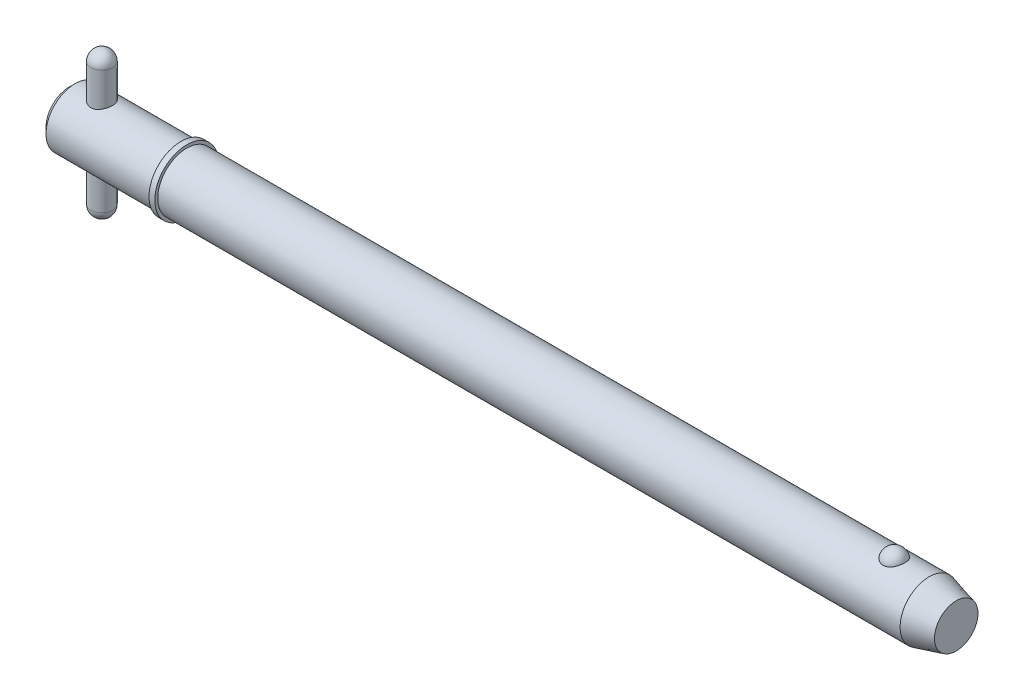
ISO-10303-21;
HEADER;
FILE_DESCRIPTION(('STEP AP214'),'2;1');
FILE_NAME('part.step','',(''),(''),'','','');
FILE_SCHEMA(('AUTOMOTIVE_DESIGN { 1 0 10303 214 1 1 1 1 }'));
ENDSEC;
DATA;
#1=APPLICATION_CONTEXT('core data for automotive mechanical design processes');
#2=APPLICATION_PROTOCOL_DEFINITION('international standard','automotive_design',2000,#1);
#3=PRODUCT_CONTEXT('',#1,'mechanical');
#4=PRODUCT('Part','Part','',(#3));
#5=PRODUCT_RELATED_PRODUCT_CATEGORY('part','',(#4));
#6=PRODUCT_DEFINITION_FORMATION('','',#4);
#7=PRODUCT_DEFINITION_CONTEXT('part definition',#1,'design');
#8=PRODUCT_DEFINITION('design','',#6,#7);
#9=PRODUCT_DEFINITION_SHAPE('','',#8);
#10=(LENGTH_UNIT() NAMED_UNIT(*) SI_UNIT(.MILLI.,.METRE.));
#11=(NAMED_UNIT(*) PLANE_ANGLE_UNIT() SI_UNIT($,.RADIAN.));
#12=(NAMED_UNIT(*) SI_UNIT($,.STERADIAN.) SOLID_ANGLE_UNIT());
#13=UNCERTAINTY_MEASURE_WITH_UNIT(LENGTH_MEASURE(1.E-05),#10,'distance_accuracy_value','');
#14=(GEOMETRIC_REPRESENTATION_CONTEXT(3) GLOBAL_UNCERTAINTY_ASSIGNED_CONTEXT((#13)) GLOBAL_UNIT_ASSIGNED_CONTEXT((#10,
#11,#12)) REPRESENTATION_CONTEXT('',''));
#15=CARTESIAN_POINT('',(0.,0.,0.));
#16=DIRECTION('',(0.,0.,1.));
#17=DIRECTION('',(1.,0.,0.));
#18=AXIS2_PLACEMENT_3D('',#15,#16,#17);
#19=CARTESIAN_POINT('',(7.14,15.875,0.));
#20=DIRECTION('',(0.,-1.,0.));
#21=DIRECTION('',(0.,0.,-1.));
#22=AXIS2_PLACEMENT_3D('',#19,#20,#21);
#23=CYLINDRICAL_SURFACE('',#22,2.38);
#24=CARTESIAN_POINT('',(7.14,-13.495,0.));
#25=DIRECTION('',(0.,-1.,0.));
#26=DIRECTION('',(0.,0.,-1.));
#27=AXIS2_PLACEMENT_3D('',#24,#25,#26);
#28=CIRCLE('',#27,2.38);
#29=CARTESIAN_POINT('',(7.14,-13.495,-2.38));
#30=VERTEX_POINT('',#29);
#31=EDGE_CURVE('P0_E10',#30,#30,#28,.F.);
#32=ORIENTED_EDGE('',*,*,#31,.T.);
#33=EDGE_LOOP('',(#32));
#34=FACE_BOUND('',#33,.T.);
#35=CARTESIAN_POINT('',(7.14,13.495,0.));
#36=DIRECTION('',(0.,-1.,0.));
#37=DIRECTION('',(0.,0.,-1.));
#38=AXIS2_PLACEMENT_3D('',#35,#36,#37);
#39=CIRCLE('',#38,2.38);
#40=CARTESIAN_POINT('',(7.14,13.495,-2.38));
#41=VERTEX_POINT('',#40);
#42=EDGE_CURVE('P0_E21',#41,#41,#39,.T.);
#43=ORIENTED_EDGE('',*,*,#42,.T.);
#44=EDGE_LOOP('',(#43));
#45=FACE_BOUND('',#44,.T.);
#46=ADVANCED_FACE('P0_F14',(#34,#45),#23,.T.);
#47=CARTESIAN_POINT('',(7.14,-13.495,0.));
#48=DIRECTION('',(0.,0.,1.));
#49=DIRECTION('',(1.,0.,0.));
#50=AXIS2_PLACEMENT_3D('',#47,#48,#49);
#51=SPHERICAL_SURFACE('',#50,2.38);
#52=CARTESIAN_POINT('',(7.14,-13.495,0.));
#53=DIRECTION('',(0.,-1.,0.));
#54=DIRECTION('',(0.,0.,-1.));
#55=AXIS2_PLACEMENT_3D('',#52,#53,#54);
#56=SPHERICAL_SURFACE('',#55,2.38);
#57=ORIENTED_EDGE('',*,*,#31,.F.);
#58=EDGE_LOOP('',(#57));
#59=FACE_BOUND('',#58,.T.);
#60=ADVANCED_FACE('P0_F29',(#59),#56,.T.);
#61=CARTESIAN_POINT('',(7.14,13.495,0.));
#62=DIRECTION('',(0.,0.,1.));
#63=DIRECTION('',(1.,0.,0.));
#64=AXIS2_PLACEMENT_3D('',#61,#62,#63);
#65=SPHERICAL_SURFACE('',#64,2.38);
#66=CARTESIAN_POINT('',(7.14,13.495,0.));
#67=DIRECTION('',(0.,-1.,0.));
#68=DIRECTION('',(0.,0.,-1.));
#69=AXIS2_PLACEMENT_3D('',#66,#67,#68);
#70=SPHERICAL_SURFACE('',#69,2.38);
#71=ORIENTED_EDGE('',*,*,#42,.F.);
#72=EDGE_LOOP('',(#71));
#73=FACE_BOUND('',#72,.T.);
#74=ADVANCED_FACE('P0_F16',(#73),#70,.T.);
#75=CLOSED_SHELL('',(#46,#60,#74));
#76=MANIFOLD_SOLID_BREP('P0_B1',#75);
#77=CARTESIAN_POINT('',(0.,0.,0.));
#78=DIRECTION('',(1.,0.,0.));
#79=DIRECTION('',(0.,0.,-1.));
#80=AXIS2_PLACEMENT_3D('',#77,#78,#79);
#81=CYLINDRICAL_SURFACE('',#80,6.35);
#82=CARTESIAN_POINT('',(188.055369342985,0.,0.));
#83=DIRECTION('',(1.,0.,0.));
#84=DIRECTION('',(0.,0.,-1.));
#85=AXIS2_PLACEMENT_3D('',#82,#83,#84);
#86=CIRCLE('',#85,6.35);
#87=CARTESIAN_POINT('',(188.055369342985,0.,-6.35));
#88=VERTEX_POINT('',#87);
#89=EDGE_CURVE('P1_E81',#88,#88,#86,.T.);
#90=ORIENTED_EDGE('',*,*,#89,.F.);
#91=EDGE_LOOP('',(#90));
#92=FACE_BOUND('',#91,.T.);
#93=CARTESIAN_POINT('',(25.7,0.,0.));
#94=DIRECTION('',(1.,0.,0.));
#95=DIRECTION('',(0.,0.,-1.));
#96=AXIS2_PLACEMENT_3D('',#93,#94,#95);
#97=CIRCLE('',#96,6.35);
#98=CARTESIAN_POINT('',(25.7,0.,-6.35));
#99=VERTEX_POINT('',#98);
#100=EDGE_CURVE('P1_E85',#99,#99,#97,.T.);
#101=ORIENTED_EDGE('',*,*,#100,.T.);
#102=EDGE_LOOP('',(#101));
#103=FACE_BOUND('',#102,.T.);
#104=CARTESIAN_POINT('',(180.430021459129,5.87502187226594,2.40969251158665));
#105=CARTESIAN_POINT('',(180.305030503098,5.87501645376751,2.40969773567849));
#106=CARTESIAN_POINT('',(180.180080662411,5.87916061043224,2.39967292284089));
#107=CARTESIAN_POINT('',(179.933909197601,5.89523112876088,2.35991730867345));
#108=CARTESIAN_POINT('',(179.812686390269,5.90715499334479,2.33019283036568));
#109=CARTESIAN_POINT('',(179.577517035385,5.93739567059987,2.25201402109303));
#110=CARTESIAN_POINT('',(179.463560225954,5.95570321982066,2.20358681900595));
#111=CARTESIAN_POINT('',(179.24557352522,5.9967206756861,2.08937987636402));
#112=CARTESIAN_POINT('',(179.141545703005,6.0194314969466,2.02359652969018));
#113=CARTESIAN_POINT('',(178.942943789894,6.06760647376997,1.87428969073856));
#114=CARTESIAN_POINT('',(178.848726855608,6.09313095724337,1.79031110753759));
#115=CARTESIAN_POINT('',(178.675255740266,6.14375873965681,1.60800178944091));
#116=CARTESIAN_POINT('',(178.596004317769,6.16886196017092,1.50966841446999));
#117=CARTESIAN_POINT('',(178.450845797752,6.21724600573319,1.29645884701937));
#118=CARTESIAN_POINT('',(178.385688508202,6.24039621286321,1.1810415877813));
#119=CARTESIAN_POINT('',(178.274703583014,6.28117277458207,0.940351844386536));
#120=CARTESIAN_POINT('',(178.228877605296,6.29879865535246,0.815078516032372));
#121=CARTESIAN_POINT('',(178.157023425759,6.32692073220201,0.556494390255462));
#122=CARTESIAN_POINT('',(178.131249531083,6.33732517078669,0.423102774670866));
#123=CARTESIAN_POINT('',(178.100988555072,6.34957673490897,0.153542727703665));
#124=CARTESIAN_POINT('',(178.096500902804,6.35142408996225,0.0173743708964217));
#125=CARTESIAN_POINT('',(178.108865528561,6.34638925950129,-0.25303667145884));
#126=CARTESIAN_POINT('',(178.125594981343,6.33955731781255,-0.387285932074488));
#127=CARTESIAN_POINT('',(178.179843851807,6.31794129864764,-0.650851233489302));
#128=CARTESIAN_POINT('',(178.217363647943,6.3031570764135,-0.780167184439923));
#129=CARTESIAN_POINT('',(178.312500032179,6.26711642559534,-1.03041949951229));
#130=CARTESIAN_POINT('',(178.370143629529,6.24585130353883,-1.15134433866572));
#131=CARTESIAN_POINT('',(178.504352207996,6.19905619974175,-1.38129800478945));
#132=CARTESIAN_POINT('',(178.580918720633,6.17352587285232,-1.49032586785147));
#133=CARTESIAN_POINT('',(178.751753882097,6.12080227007,-1.69393164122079));
#134=CARTESIAN_POINT('',(178.846100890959,6.09360200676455,-1.78844209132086));
#135=CARTESIAN_POINT('',(179.050119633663,6.04070434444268,-1.95970536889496));
#136=CARTESIAN_POINT('',(179.159790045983,6.015006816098,-2.0364597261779));
#137=CARTESIAN_POINT('',(179.389187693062,5.96867714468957,-2.16845644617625));
#138=CARTESIAN_POINT('',(179.508652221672,5.94794910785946,-2.22412062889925));
#139=CARTESIAN_POINT('',(179.756218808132,5.91340580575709,-2.31440992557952));
#140=CARTESIAN_POINT('',(179.884317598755,5.89958794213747,-2.34904294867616));
#141=CARTESIAN_POINT('',(180.138582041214,5.88111049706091,-2.39491590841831));
#142=CARTESIAN_POINT('',(180.264520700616,5.87602512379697,-2.40724512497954));
#143=CARTESIAN_POINT('',(180.516786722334,5.87428980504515,-2.41147867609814));
#144=CARTESIAN_POINT('',(180.643114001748,5.8776381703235,-2.40338710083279));
#145=CARTESIAN_POINT('',(180.888417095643,5.89212921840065,-2.36762715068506));
#146=CARTESIAN_POINT('',(181.007499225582,5.90302431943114,-2.3405803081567));
#147=CARTESIAN_POINT('',(181.23924472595,5.93113752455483,-2.26839066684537));
#148=CARTESIAN_POINT('',(181.351907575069,5.94835614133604,-2.22324640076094));
#149=CARTESIAN_POINT('',(181.570400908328,5.9877301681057,-2.11493806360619));
#150=CARTESIAN_POINT('',(181.676028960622,6.00998499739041,-2.05140269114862));
#151=CARTESIAN_POINT('',(181.875300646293,6.05690144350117,-1.90842705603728));
#152=CARTESIAN_POINT('',(181.968941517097,6.08156361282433,-1.82898313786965));
#153=CARTESIAN_POINT('',(182.146675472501,6.13211715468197,-1.65182429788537));
#154=CARTESIAN_POINT('',(182.230055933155,6.15800825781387,-1.55339381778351));
#155=CARTESIAN_POINT('',(182.379790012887,6.20712834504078,-1.34374214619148));
#156=CARTESIAN_POINT('',(182.446140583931,6.23035685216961,-1.23251867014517));
#157=CARTESIAN_POINT('',(182.562345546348,6.27251177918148,-0.996447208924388));
#158=CARTESIAN_POINT('',(182.611607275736,6.29127762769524,-0.871278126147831));
#159=CARTESIAN_POINT('',(182.689614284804,6.3215862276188,-0.613870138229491));
#160=CARTESIAN_POINT('',(182.718359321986,6.33312889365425,-0.481631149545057));
#161=CARTESIAN_POINT('',(182.754770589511,6.34782349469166,-0.213672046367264));
#162=CARTESIAN_POINT('',(182.762413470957,6.35096613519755,-0.0779482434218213));
#163=CARTESIAN_POINT('',(182.756395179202,6.34851322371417,0.192943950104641));
#164=CARTESIAN_POINT('',(182.742734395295,6.3429178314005,0.328112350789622));
#165=CARTESIAN_POINT('',(182.69450361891,6.32360512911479,0.593406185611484));
#166=CARTESIAN_POINT('',(182.660031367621,6.30992579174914,0.723552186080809));
#167=CARTESIAN_POINT('',(182.570953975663,6.27586325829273,0.97583417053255));
#168=CARTESIAN_POINT('',(182.51634761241,6.25547965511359,1.09796966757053));
#169=CARTESIAN_POINT('',(182.38775879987,6.20998183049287,1.33148921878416));
#170=CARTESIAN_POINT('',(182.313674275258,6.18484288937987,1.44281227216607));
#171=CARTESIAN_POINT('',(182.147820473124,6.13258735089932,1.65087683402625));
#172=CARTESIAN_POINT('',(182.056051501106,6.10547078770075,1.7476185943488));
#173=CARTESIAN_POINT('',(181.857183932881,6.05235879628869,1.92350926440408));
#174=CARTESIAN_POINT('',(181.750133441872,6.02636017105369,2.00271146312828));
#175=CARTESIAN_POINT('',(181.523138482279,5.97843747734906,2.14154159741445));
#176=CARTESIAN_POINT('',(181.403191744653,5.9565141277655,2.20116608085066));
#177=CARTESIAN_POINT('',(181.144523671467,5.91812106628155,2.30250570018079));
#178=CARTESIAN_POINT('',(181.00506980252,5.90217533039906,2.34256795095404));
#179=CARTESIAN_POINT('',(180.720397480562,5.88063128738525,2.3961521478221));
#180=CARTESIAN_POINT('',(180.57518174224,5.87502816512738,2.40968644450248));
#181=CARTESIAN_POINT('',(180.430021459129,5.87502187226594,2.40969251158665));
#182=B_SPLINE_CURVE_WITH_KNOTS('',3,(#104,#105,#106,#107,#108,#109,#110,#111,#112,#113,#114,
#115,#116,#117,#118,#119,#120,#121,#122,#123,#124,#125,#126,#127,#128,#129,#130,#131,#132,#133,
#134,#135,#136,#137,#138,#139,#140,#141,#142,#143,#144,#145,#146,#147,#148,#149,#150,#151,#152,
#153,#154,#155,#156,#157,#158,#159,#160,#161,#162,#163,#164,#165,#166,#167,#168,#169,#170,#171,
#172,#173,#174,#175,#176,#177,#178,#179,#180,#181),.UNSPECIFIED.,.T.,.F.,(4,2,2,2,2,2,2,2,2,2,2,
2,2,2,2,2,2,2,2,2,2,2,2,2,2,2,2,2,2,2,2,2,2,2,2,2,2,2,4),(0.,0.374440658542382,
0.748761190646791,1.12254078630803,1.4963981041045,1.88098871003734,2.26565013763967,
2.66741104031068,3.06920639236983,3.47601794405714,3.88281858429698,4.28727498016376,
4.69173873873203,5.09674745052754,5.50178895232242,5.90865911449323,6.31549420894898,
6.71369855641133,7.11175305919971,7.48978077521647,7.86773278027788,8.23383886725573,
8.59997464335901,8.97409044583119,9.34829231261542,9.74122667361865,10.1342313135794,
10.5397522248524,10.9452779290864,11.3512521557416,11.75721896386,12.1612938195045,
12.5653932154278,12.9716540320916,13.3779078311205,13.7829098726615,14.1879832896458,
14.6230486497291,15.0579114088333),.UNSPECIFIED.);
#183=CARTESIAN_POINT('',(180.430021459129,5.87502187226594,2.40969251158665));
#184=VERTEX_POINT('',#183);
#185=EDGE_CURVE('P1_E35',#184,#184,#182,.T.);
#186=ORIENTED_EDGE('',*,*,#185,.T.);
#187=EDGE_LOOP('',(#186));
#188=FACE_BOUND('',#187,.T.);
#189=ADVANCED_FACE('P1_F13',(#92,#103,#188),#81,.T.);
#190=CARTESIAN_POINT('',(0.,0.,0.));
#191=DIRECTION('',(-1.,0.,0.));
#192=DIRECTION('',(0.,0.,1.));
#193=AXIS2_PLACEMENT_3D('',#190,#191,#192);
#194=PLANE('',#193);
#195=CARTESIAN_POINT('',(0.,0.,0.));
#196=DIRECTION('',(1.,0.,0.));
#197=DIRECTION('',(0.,0.,-1.));
#198=AXIS2_PLACEMENT_3D('',#195,#196,#197);
#199=CIRCLE('',#198,5.08);
#200=CARTESIAN_POINT('',(0.,0.,-5.08));
#201=VERTEX_POINT('',#200);
#202=EDGE_CURVE('P1_E9',#201,#201,#199,.T.);
#203=ORIENTED_EDGE('',*,*,#202,.F.);
#204=EDGE_LOOP('',(#203));
#205=FACE_BOUND('',#204,.T.);
#206=ADVANCED_FACE('P1_F15',(#205),#194,.T.);
#207=CARTESIAN_POINT('',(1.27,0.,0.));
#208=DIRECTION('',(1.,0.,0.));
#209=DIRECTION('',(0.,0.,-1.));
#210=AXIS2_PLACEMENT_3D('',#207,#208,#209);
#211=CONICAL_SURFACE('',#210,6.35,0.78539816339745);
#212=ORIENTED_EDGE('',*,*,#202,.T.);
#213=EDGE_LOOP('',(#212));
#214=FACE_BOUND('',#213,.T.);
#215=CARTESIAN_POINT('',(1.27,0.,0.));
#216=DIRECTION('',(1.,0.,0.));
#217=DIRECTION('',(0.,0.,-1.));
#218=AXIS2_PLACEMENT_3D('',#215,#216,#217);
#219=CIRCLE('',#218,6.35);
#220=CARTESIAN_POINT('',(1.27,0.,-6.35));
#221=VERTEX_POINT('',#220);
#222=EDGE_CURVE('P1_E26',#221,#221,#219,.T.);
#223=ORIENTED_EDGE('',*,*,#222,.F.);
#224=EDGE_LOOP('',(#223));
#225=FACE_BOUND('',#224,.T.);
#226=ADVANCED_FACE('P1_F77',(#214,#225),#211,.T.);
#227=CARTESIAN_POINT('',(0.,0.,0.));
#228=DIRECTION('',(1.,0.,0.));
#229=DIRECTION('',(0.,0.,-1.));
#230=AXIS2_PLACEMENT_3D('',#227,#228,#229);
#231=CYLINDRICAL_SURFACE('',#230,6.35);
#232=CARTESIAN_POINT('',(7.14,-5.88711304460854,2.38));
#233=CARTESIAN_POINT('',(7.01146258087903,-5.88710856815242,2.38000480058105));
#234=CARTESIAN_POINT('',(6.88295682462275,-5.89136840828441,2.36955244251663));
#235=CARTESIAN_POINT('',(6.62981934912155,-5.90782785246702,2.32820953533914));
#236=CARTESIAN_POINT('',(6.50518751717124,-5.92002722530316,2.29731958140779));
#237=CARTESIAN_POINT('',(6.26352403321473,-5.95079384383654,2.21639366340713));
#238=CARTESIAN_POINT('',(6.14647496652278,-5.96934583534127,2.16640353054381));
#239=CARTESIAN_POINT('',(5.92237941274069,-6.01070278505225,2.04885862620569));
#240=CARTESIAN_POINT('',(5.81533593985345,-6.03350901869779,1.98129858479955));
#241=CARTESIAN_POINT('',(5.60897525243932,-6.08207341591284,1.82693902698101));
#242=CARTESIAN_POINT('',(5.51022503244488,-6.10791836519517,1.73940861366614));
#243=CARTESIAN_POINT('',(5.32840561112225,-6.15892405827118,1.54914379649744));
#244=CARTESIAN_POINT('',(5.24533975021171,-6.1840846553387,1.44640616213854));
#245=CARTESIAN_POINT('',(5.09451639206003,-6.23191821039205,1.22434014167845));
#246=CARTESIAN_POINT('',(5.02737511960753,-6.25447755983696,1.10456656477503));
#247=CARTESIAN_POINT('',(4.91443001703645,-6.2935236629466,0.854429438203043));
#248=CARTESIAN_POINT('',(4.86861879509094,-6.31001251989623,0.724069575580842));
#249=CARTESIAN_POINT('',(4.80162253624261,-6.33444370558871,0.46242122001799));
#250=CARTESIAN_POINT('',(4.77946137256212,-6.34272370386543,0.331414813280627));
#251=CARTESIAN_POINT('',(4.75726677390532,-6.35101600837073,0.0672982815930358));
#252=CARTESIAN_POINT('',(4.75722615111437,-6.35103100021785,-0.0658111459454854));
#253=CARTESIAN_POINT('',(4.77870510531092,-6.3430064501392,-0.323358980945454));
#254=CARTESIAN_POINT('',(4.79915922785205,-6.33536494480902,-0.447900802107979));
#255=CARTESIAN_POINT('',(4.85925493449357,-6.31340794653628,-0.69163609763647));
#256=CARTESIAN_POINT('',(4.89889787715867,-6.29909198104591,-0.810829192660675));
#257=CARTESIAN_POINT('',(4.9967414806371,-6.26494471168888,-1.04254212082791));
#258=CARTESIAN_POINT('',(5.05520370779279,-6.24503620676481,-1.1549396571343));
#259=CARTESIAN_POINT('',(5.1887948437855,-6.20171869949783,-1.3686079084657));
#260=CARTESIAN_POINT('',(5.26392912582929,-6.17830856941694,-1.46987502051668));
#261=CARTESIAN_POINT('',(5.43386591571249,-6.12878580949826,-1.66468415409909));
#262=CARTESIAN_POINT('',(5.52956139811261,-6.10259519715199,-1.75742857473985));
#263=CARTESIAN_POINT('',(5.73530435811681,-6.05155777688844,-1.92585331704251));
#264=CARTESIAN_POINT('',(5.84535542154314,-6.02671130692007,-2.00152936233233));
#265=CARTESIAN_POINT('',(6.07982989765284,-5.98068420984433,-2.13519109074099));
#266=CARTESIAN_POINT('',(6.20451768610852,-5.95959698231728,-2.19274775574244));
#267=CARTESIAN_POINT('',(6.4628145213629,-5.92455622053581,-2.28574558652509));
#268=CARTESIAN_POINT('',(6.59641856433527,-5.91059872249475,-2.32119904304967));
#269=CARTESIAN_POINT('',(6.86087441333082,-5.8923327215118,-2.36717069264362));
#270=CARTESIAN_POINT('',(6.99147192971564,-5.8875347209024,-2.37895573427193));
#271=CARTESIAN_POINT('',(7.25283805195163,-5.88674545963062,-2.38091046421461));
#272=CARTESIAN_POINT('',(7.38360660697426,-5.89075200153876,-2.37108554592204));
#273=CARTESIAN_POINT('',(7.63510696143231,-5.90662331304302,-2.33124781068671));
#274=CARTESIAN_POINT('',(7.75602069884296,-5.91810660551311,-2.30221396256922));
#275=CARTESIAN_POINT('',(7.99120505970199,-5.94718527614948,-2.22601401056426));
#276=CARTESIAN_POINT('',(8.10547431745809,-5.96478190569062,-2.17884419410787));
#277=CARTESIAN_POINT('',(8.32888632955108,-6.00491533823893,-2.06572311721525));
#278=CARTESIAN_POINT('',(8.43767672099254,-6.02761250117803,-1.99913452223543));
#279=CARTESIAN_POINT('',(8.6429894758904,-6.07511988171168,-1.84974438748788));
#280=CARTESIAN_POINT('',(8.73950733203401,-6.09993087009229,-1.76693691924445));
#281=CARTESIAN_POINT('',(8.9238741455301,-6.1507686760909,-1.58125563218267));
#282=CARTESIAN_POINT('',(9.01078732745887,-6.17677301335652,-1.47744327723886));
#283=CARTESIAN_POINT('',(9.16607127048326,-6.22556172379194,-1.25606967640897));
#284=CARTESIAN_POINT('',(9.23444197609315,-6.24834608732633,-1.13850838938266));
#285=CARTESIAN_POINT('',(9.3502493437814,-6.28811144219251,-0.893050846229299));
#286=CARTESIAN_POINT('',(9.39775808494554,-6.30511236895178,-0.765192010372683));
#287=CARTESIAN_POINT('',(9.47032640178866,-6.33145833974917,-0.502514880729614));
#288=CARTESIAN_POINT('',(9.49539651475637,-6.34080697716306,-0.367699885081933));
#289=CARTESIAN_POINT('',(9.52124059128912,-6.35045496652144,-0.103396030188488));
#290=CARTESIAN_POINT('',(9.52334421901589,-6.35124952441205,0.025945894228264));
#291=CARTESIAN_POINT('',(9.50661518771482,-6.34499064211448,0.283061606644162));
#292=CARTESIAN_POINT('',(9.48778504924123,-6.33793814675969,0.410835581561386));
#293=CARTESIAN_POINT('',(9.43065630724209,-6.31700307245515,0.658028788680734));
#294=CARTESIAN_POINT('',(9.39284291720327,-6.30329098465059,0.7775756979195));
#295=CARTESIAN_POINT('',(9.29930406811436,-6.27046903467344,1.00863789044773));
#296=CARTESIAN_POINT('',(9.2435752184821,-6.25135815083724,1.12015164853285));
#297=CARTESIAN_POINT('',(9.11312349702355,-6.20865254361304,1.33711407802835));
#298=CARTESIAN_POINT('',(9.03770094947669,-6.18490316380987,1.44211105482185));
#299=CARTESIAN_POINT('',(8.87110640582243,-6.13583718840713,1.63836897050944));
#300=CARTESIAN_POINT('',(8.77992879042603,-6.11052003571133,1.72962498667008));
#301=CARTESIAN_POINT('',(8.57869799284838,-6.05953829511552,1.90076098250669));
#302=CARTESIAN_POINT('',(8.46790320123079,-6.03392573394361,1.97978778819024));
#303=CARTESIAN_POINT('',(8.23379693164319,-5.98676607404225,2.11813466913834));
#304=CARTESIAN_POINT('',(8.11048418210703,-5.9652193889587,2.17745273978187));
#305=CARTESIAN_POINT('',(7.84900037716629,-5.92818393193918,2.27641807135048));
#306=CARTESIAN_POINT('',(7.71041678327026,-5.91299857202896,2.31510015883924));
#307=CARTESIAN_POINT('',(7.42787316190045,-5.89246887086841,2.36688002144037));
#308=CARTESIAN_POINT('',(7.28391673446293,-5.88711805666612,2.37999462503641));
#309=CARTESIAN_POINT('',(7.14,-5.88711304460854,2.38));
#310=B_SPLINE_CURVE_WITH_KNOTS('',3,(#232,#233,#234,#235,#236,#237,#238,#239,#240,#241,#242,
#243,#244,#245,#246,#247,#248,#249,#250,#251,#252,#253,#254,#255,#256,#257,#258,#259,#260,#261,
#262,#263,#264,#265,#266,#267,#268,#269,#270,#271,#272,#273,#274,#275,#276,#277,#278,#279,#280,
#281,#282,#283,#284,#285,#286,#287,#288,#289,#290,#291,#292,#293,#294,#295,#296,#297,#298,#299,
#300,#301,#302,#303,#304,#305,#306,#307,#308,#309),.UNSPECIFIED.,.T.,.F.,(4,2,2,2,2,2,2,2,2,2,2,
2,2,2,2,2,2,2,2,2,2,2,2,2,2,2,2,2,2,2,2,2,2,2,2,2,2,2,4),(0.,0.385076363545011,
0.770141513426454,1.15428843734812,1.53855071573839,1.94016118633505,2.3418570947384,
2.75720522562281,3.1724093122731,3.569721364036,3.96690431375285,4.34445758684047,
4.72203759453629,5.10511017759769,5.48830640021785,5.89390240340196,6.29959991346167,
6.71428455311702,7.12873839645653,7.52034494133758,7.91185376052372,8.28480528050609,
8.65783318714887,9.0448340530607,9.43197664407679,9.84363087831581,10.2552863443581,
10.6655081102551,11.0755371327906,11.4616919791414,11.847800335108,12.224507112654,
12.6012852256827,12.9938941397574,13.386643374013,13.8000944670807,14.2135876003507,
14.6450218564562,15.0761720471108),.UNSPECIFIED.);
#311=CARTESIAN_POINT('',(7.14,-5.88711304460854,2.38));
#312=VERTEX_POINT('',#311);
#313=EDGE_CURVE('P1_E17',#312,#312,#310,.T.);
#314=ORIENTED_EDGE('',*,*,#313,.F.);
#315=EDGE_LOOP('',(#314));
#316=FACE_BOUND('',#315,.T.);
#317=CARTESIAN_POINT('',(7.14,5.88711304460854,2.38));
#318=CARTESIAN_POINT('',(7.26853741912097,5.88710856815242,2.38000480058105));
#319=CARTESIAN_POINT('',(7.39704317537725,5.89136840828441,2.36955244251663));
#320=CARTESIAN_POINT('',(7.65018065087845,5.90782785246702,2.32820953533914));
#321=CARTESIAN_POINT('',(7.77481248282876,5.92002722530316,2.29731958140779));
#322=CARTESIAN_POINT('',(8.01647596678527,5.95079384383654,2.21639366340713));
#323=CARTESIAN_POINT('',(8.13352503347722,5.96934583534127,2.16640353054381));
#324=CARTESIAN_POINT('',(8.35762058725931,6.01070278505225,2.04885862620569));
#325=CARTESIAN_POINT('',(8.46466406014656,6.03350901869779,1.98129858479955));
#326=CARTESIAN_POINT('',(8.67102474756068,6.08207341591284,1.82693902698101));
#327=CARTESIAN_POINT('',(8.76977496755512,6.10791836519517,1.73940861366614));
#328=CARTESIAN_POINT('',(8.95159438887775,6.15892405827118,1.54914379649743));
#329=CARTESIAN_POINT('',(9.03466024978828,6.1840846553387,1.44640616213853));
#330=CARTESIAN_POINT('',(9.18548360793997,6.23191821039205,1.22434014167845));
#331=CARTESIAN_POINT('',(9.25262488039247,6.25447755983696,1.10456656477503));
#332=CARTESIAN_POINT('',(9.36556998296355,6.2935236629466,0.854429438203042));
#333=CARTESIAN_POINT('',(9.41138120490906,6.31001251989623,0.72406957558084));
#334=CARTESIAN_POINT('',(9.47837746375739,6.33444370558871,0.462421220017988));
#335=CARTESIAN_POINT('',(9.50053862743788,6.34272370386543,0.331414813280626));
#336=CARTESIAN_POINT('',(9.52273322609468,6.35101600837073,0.0672982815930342));
#337=CARTESIAN_POINT('',(9.52277384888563,6.35103100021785,-0.0658111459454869));
#338=CARTESIAN_POINT('',(9.50129489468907,6.3430064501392,-0.323358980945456));
#339=CARTESIAN_POINT('',(9.48084077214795,6.33536494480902,-0.447900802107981));
#340=CARTESIAN_POINT('',(9.42074506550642,6.31340794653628,-0.691636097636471));
#341=CARTESIAN_POINT('',(9.38110212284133,6.29909198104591,-0.810829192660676));
#342=CARTESIAN_POINT('',(9.2832585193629,6.26494471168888,-1.04254212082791));
#343=CARTESIAN_POINT('',(9.22479629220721,6.24503620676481,-1.1549396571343));
#344=CARTESIAN_POINT('',(9.0912051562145,6.20171869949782,-1.3686079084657));
#345=CARTESIAN_POINT('',(9.0160708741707,6.17830856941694,-1.46987502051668));
#346=CARTESIAN_POINT('',(8.84613408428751,6.12878580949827,-1.66468415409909));
#347=CARTESIAN_POINT('',(8.75043860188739,6.10259519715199,-1.75742857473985));
#348=CARTESIAN_POINT('',(8.54469564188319,6.05155777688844,-1.92585331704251));
#349=CARTESIAN_POINT('',(8.43464457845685,6.02671130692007,-2.00152936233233));
#350=CARTESIAN_POINT('',(8.20017010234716,5.98068420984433,-2.13519109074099));
#351=CARTESIAN_POINT('',(8.07548231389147,5.95959698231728,-2.19274775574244));
#352=CARTESIAN_POINT('',(7.8171854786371,5.9245562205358,-2.28574558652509));
#353=CARTESIAN_POINT('',(7.68358143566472,5.91059872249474,-2.32119904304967));
#354=CARTESIAN_POINT('',(7.41912558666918,5.8923327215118,-2.36717069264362));
#355=CARTESIAN_POINT('',(7.28852807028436,5.8875347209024,-2.37895573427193));
#356=CARTESIAN_POINT('',(7.02716194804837,5.88674545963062,-2.38091046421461));
#357=CARTESIAN_POINT('',(6.89639339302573,5.89075200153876,-2.37108554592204));
#358=CARTESIAN_POINT('',(6.64489303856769,5.90662331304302,-2.33124781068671));
#359=CARTESIAN_POINT('',(6.52397930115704,5.91810660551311,-2.30221396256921));
#360=CARTESIAN_POINT('',(6.288794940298,5.94718527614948,-2.22601401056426));
#361=CARTESIAN_POINT('',(6.17452568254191,5.96478190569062,-2.17884419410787));
#362=CARTESIAN_POINT('',(5.95111367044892,6.00491533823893,-2.06572311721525));
#363=CARTESIAN_POINT('',(5.84232327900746,6.02761250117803,-1.99913452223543));
#364=CARTESIAN_POINT('',(5.6370105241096,6.07511988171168,-1.84974438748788));
#365=CARTESIAN_POINT('',(5.54049266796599,6.09993087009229,-1.76693691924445));
#366=CARTESIAN_POINT('',(5.3561258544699,6.1507686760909,-1.58125563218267));
#367=CARTESIAN_POINT('',(5.26921267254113,6.17677301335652,-1.47744327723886));
#368=CARTESIAN_POINT('',(5.11392872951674,6.22556172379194,-1.25606967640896));
#369=CARTESIAN_POINT('',(5.04555802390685,6.24834608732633,-1.13850838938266));
#370=CARTESIAN_POINT('',(4.9297506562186,6.28811144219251,-0.893050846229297));
#371=CARTESIAN_POINT('',(4.88224191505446,6.30511236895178,-0.76519201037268));
#372=CARTESIAN_POINT('',(4.80967359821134,6.33145833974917,-0.502514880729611));
#373=CARTESIAN_POINT('',(4.78460348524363,6.34080697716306,-0.36769988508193));
#374=CARTESIAN_POINT('',(4.75875940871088,6.35045496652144,-0.103396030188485));
#375=CARTESIAN_POINT('',(4.75665578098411,6.35124952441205,0.025945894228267));
#376=CARTESIAN_POINT('',(4.77338481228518,6.34499064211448,0.283061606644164));
#377=CARTESIAN_POINT('',(4.79221495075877,6.33793814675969,0.410835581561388));
#378=CARTESIAN_POINT('',(4.84934369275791,6.31700307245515,0.658028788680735));
#379=CARTESIAN_POINT('',(4.88715708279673,6.30329098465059,0.777575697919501));
#380=CARTESIAN_POINT('',(4.98069593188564,6.27046903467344,1.00863789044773));
#381=CARTESIAN_POINT('',(5.0364247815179,6.25135815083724,1.12015164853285));
#382=CARTESIAN_POINT('',(5.16687650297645,6.20865254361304,1.33711407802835));
#383=CARTESIAN_POINT('',(5.24229905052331,6.18490316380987,1.44211105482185));
#384=CARTESIAN_POINT('',(5.40889359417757,6.13583718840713,1.63836897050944));
#385=CARTESIAN_POINT('',(5.50007120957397,6.11052003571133,1.72962498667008));
#386=CARTESIAN_POINT('',(5.70130200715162,6.05953829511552,1.90076098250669));
#387=CARTESIAN_POINT('',(5.81209679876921,6.03392573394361,1.97978778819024));
#388=CARTESIAN_POINT('',(6.04620306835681,5.98676607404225,2.11813466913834));
#389=CARTESIAN_POINT('',(6.16951581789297,5.9652193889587,2.17745273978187));
#390=CARTESIAN_POINT('',(6.43099962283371,5.92818393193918,2.27641807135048));
#391=CARTESIAN_POINT('',(6.56958321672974,5.91299857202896,2.31510015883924));
#392=CARTESIAN_POINT('',(6.85212683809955,5.89246887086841,2.36688002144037));
#393=CARTESIAN_POINT('',(6.99608326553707,5.88711805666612,2.37999462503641));
#394=CARTESIAN_POINT('',(7.14,5.88711304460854,2.38));
#395=B_SPLINE_CURVE_WITH_KNOTS('',3,(#317,#318,#319,#320,#321,#322,#323,#324,#325,#326,#327,
#328,#329,#330,#331,#332,#333,#334,#335,#336,#337,#338,#339,#340,#341,#342,#343,#344,#345,#346,
#347,#348,#349,#350,#351,#352,#353,#354,#355,#356,#357,#358,#359,#360,#361,#362,#363,#364,#365,
#366,#367,#368,#369,#370,#371,#372,#373,#374,#375,#376,#377,#378,#379,#380,#381,#382,#383,#384,
#385,#386,#387,#388,#389,#390,#391,#392,#393,#394),.UNSPECIFIED.,.T.,.F.,(4,2,2,2,2,2,2,2,2,2,2,
2,2,2,2,2,2,2,2,2,2,2,2,2,2,2,2,2,2,2,2,2,2,2,2,2,2,2,4),(0.,0.385076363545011,
0.770141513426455,1.15428843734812,1.53855071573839,1.94016118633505,2.3418570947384,
2.75720522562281,3.1724093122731,3.56972136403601,3.96690431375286,4.34445758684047,
4.72203759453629,5.10511017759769,5.48830640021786,5.89390240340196,6.29959991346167,
6.71428455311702,7.12873839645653,7.52034494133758,7.91185376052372,8.2848052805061,
8.65783318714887,9.0448340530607,9.43197664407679,9.84363087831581,10.2552863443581,
10.6655081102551,11.0755371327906,11.4616919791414,11.847800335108,12.2245071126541,
12.6012852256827,12.9938941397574,13.386643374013,13.8000944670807,14.2135876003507,
14.6450218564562,15.0761720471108),.UNSPECIFIED.);
#396=CARTESIAN_POINT('',(7.14,5.88711304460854,2.38));
#397=VERTEX_POINT('',#396);
#398=EDGE_CURVE('P1_E43',#397,#397,#395,.T.);
#399=ORIENTED_EDGE('',*,*,#398,.F.);
#400=EDGE_LOOP('',(#399));
#401=FACE_BOUND('',#400,.T.);
#402=ORIENTED_EDGE('',*,*,#222,.T.);
#403=EDGE_LOOP('',(#402));
#404=FACE_BOUND('',#403,.T.);
#405=CARTESIAN_POINT('',(24.43,0.,0.));
#406=DIRECTION('',(1.,0.,0.));
#407=DIRECTION('',(0.,0.,-1.));
#408=AXIS2_PLACEMENT_3D('',#405,#406,#407);
#409=CIRCLE('',#408,6.35);
#410=CARTESIAN_POINT('',(24.43,0.,-6.35));
#411=VERTEX_POINT('',#410);
#412=EDGE_CURVE('P1_E31',#411,#411,#409,.T.);
#413=ORIENTED_EDGE('',*,*,#412,.F.);
#414=EDGE_LOOP('',(#413));
#415=FACE_BOUND('',#414,.T.);
#416=ADVANCED_FACE('P1_F103',(#316,#401,#404,#415),#231,.T.);
#417=CARTESIAN_POINT('',(24.43,6.35,0.));
#418=DIRECTION('',(-1.,0.,0.));
#419=DIRECTION('',(0.,0.,1.));
#420=AXIS2_PLACEMENT_3D('',#417,#418,#419);
#421=PLANE('',#420);
#422=ORIENTED_EDGE('',*,*,#412,.T.);
#423=EDGE_LOOP('',(#422));
#424=FACE_BOUND('',#423,.T.);
#425=CARTESIAN_POINT('',(24.43,0.,0.));
#426=DIRECTION('',(1.,0.,0.));
#427=DIRECTION('',(0.,0.,-1.));
#428=AXIS2_PLACEMENT_3D('',#425,#426,#427);
#429=CIRCLE('',#428,6.985);
#430=CARTESIAN_POINT('',(24.43,0.,-6.985));
#431=VERTEX_POINT('',#430);
#432=EDGE_CURVE('P1_E91',#431,#431,#429,.T.);
#433=ORIENTED_EDGE('',*,*,#432,.F.);
#434=EDGE_LOOP('',(#433));
#435=FACE_BOUND('',#434,.T.);
#436=ADVANCED_FACE('P1_F100',(#424,#435),#421,.T.);
#437=CARTESIAN_POINT('',(0.,0.,0.));
#438=DIRECTION('',(1.,0.,0.));
#439=DIRECTION('',(0.,0.,-1.));
#440=AXIS2_PLACEMENT_3D('',#437,#438,#439);
#441=CYLINDRICAL_SURFACE('',#440,6.985);
#442=ORIENTED_EDGE('',*,*,#432,.T.);
#443=EDGE_LOOP('',(#442));
#444=FACE_BOUND('',#443,.T.);
#445=CARTESIAN_POINT('',(25.7,0.,0.));
#446=DIRECTION('',(1.,0.,0.));
#447=DIRECTION('',(0.,0.,-1.));
#448=AXIS2_PLACEMENT_3D('',#445,#446,#447);
#449=CIRCLE('',#448,6.985);
#450=CARTESIAN_POINT('',(25.7,0.,-6.985));
#451=VERTEX_POINT('',#450);
#452=EDGE_CURVE('P1_E88',#451,#451,#449,.T.);
#453=ORIENTED_EDGE('',*,*,#452,.F.);
#454=EDGE_LOOP('',(#453));
#455=FACE_BOUND('',#454,.T.);
#456=ADVANCED_FACE('P1_F68',(#444,#455),#441,.T.);
#457=CARTESIAN_POINT('',(25.7,6.985,0.));
#458=DIRECTION('',(1.,0.,0.));
#459=DIRECTION('',(0.,0.,-1.));
#460=AXIS2_PLACEMENT_3D('',#457,#458,#459);
#461=PLANE('',#460);
#462=ORIENTED_EDGE('',*,*,#452,.T.);
#463=EDGE_LOOP('',(#462));
#464=FACE_BOUND('',#463,.T.);
#465=ORIENTED_EDGE('',*,*,#100,.F.);
#466=EDGE_LOOP('',(#465));
#467=FACE_BOUND('',#466,.T.);
#468=ADVANCED_FACE('P1_F62',(#464,#467),#461,.T.);
#469=CARTESIAN_POINT('',(193.98,0.,0.));
#470=DIRECTION('',(-1.,0.,0.));
#471=DIRECTION('',(0.,0.,1.));
#472=AXIS2_PLACEMENT_3D('',#469,#470,#471);
#473=CONICAL_SURFACE('',#472,4.76250000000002,0.26179938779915);
#474=ORIENTED_EDGE('',*,*,#89,.T.);
#475=EDGE_LOOP('',(#474));
#476=FACE_BOUND('',#475,.T.);
#477=CARTESIAN_POINT('',(193.98,0.,0.));
#478=DIRECTION('',(1.,0.,0.));
#479=DIRECTION('',(0.,0.,-1.));
#480=AXIS2_PLACEMENT_3D('',#477,#478,#479);
#481=CIRCLE('',#480,4.76250000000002);
#482=CARTESIAN_POINT('',(193.98,0.,-4.76250000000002));
#483=VERTEX_POINT('',#482);
#484=EDGE_CURVE('P1_E42',#483,#483,#481,.T.);
#485=ORIENTED_EDGE('',*,*,#484,.F.);
#486=EDGE_LOOP('',(#485));
#487=FACE_BOUND('',#486,.T.);
#488=ADVANCED_FACE('P1_F59',(#476,#487),#473,.T.);
#489=CARTESIAN_POINT('',(193.98,4.76250000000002,0.));
#490=DIRECTION('',(1.,0.,0.));
#491=DIRECTION('',(0.,0.,-1.));
#492=AXIS2_PLACEMENT_3D('',#489,#490,#491);
#493=PLANE('',#492);
#494=ORIENTED_EDGE('',*,*,#484,.T.);
#495=EDGE_LOOP('',(#494));
#496=FACE_BOUND('',#495,.T.);
#497=ADVANCED_FACE('P1_F55',(#496),#493,.T.);
#498=CARTESIAN_POINT('',(180.430021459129,5.715,0.));
#499=DIRECTION('',(-1.,0.,0.));
#500=DIRECTION('',(0.,1.,0.));
#501=AXIS2_PLACEMENT_3D('',#498,#499,#500);
#502=SPHERICAL_SURFACE('',#501,2.41500000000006);
#503=ORIENTED_EDGE('',*,*,#185,.F.);
#504=EDGE_LOOP('',(#503));
#505=FACE_BOUND('',#504,.T.);
#506=ADVANCED_FACE('P1_F50',(#505),#502,.T.);
#507=CARTESIAN_POINT('',(7.14,-6.985,0.));
#508=DIRECTION('',(0.,1.,0.));
#509=DIRECTION('',(0.,0.,1.));
#510=AXIS2_PLACEMENT_3D('',#507,#508,#509);
#511=CYLINDRICAL_SURFACE('',#510,2.38);
#512=ORIENTED_EDGE('',*,*,#313,.T.);
#513=EDGE_LOOP('',(#512));
#514=FACE_BOUND('',#513,.T.);
#515=ORIENTED_EDGE('',*,*,#398,.T.);
#516=EDGE_LOOP('',(#515));
#517=FACE_BOUND('',#516,.T.);
#518=ADVANCED_FACE('P1_F54',(#514,#517),#511,.F.);
#519=CLOSED_SHELL('',(#189,#206,#226,#416,#436,#456,#468,#488,#497,#506,#518));
#520=MANIFOLD_SOLID_BREP('P1_B1',#519);
#521=ADVANCED_BREP_SHAPE_REPRESENTATION('',(#18,#76,#520),#14);
#522=SHAPE_DEFINITION_REPRESENTATION(#9,#521);
ENDSEC;
END-ISO-10303-21;
